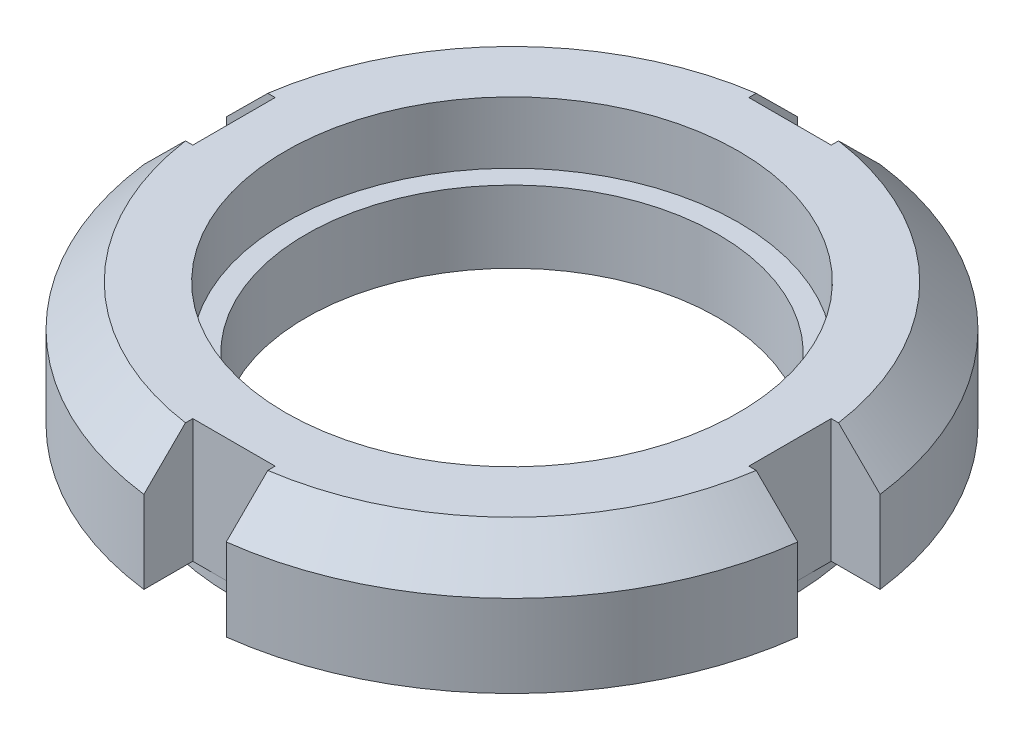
from build123d import *

# Parameters (mm, degrees)
ESQUISSE10_W                 = 2.5
ESQUISSE10_H                 = 4
ENL_V_MAT_EXTRU_1_DEPTH      = 24.542514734
R_P_TITION_CIRCULAIRE1_COUNT = 4


with BuildPart() as part:
    # Esquisse9 → R_volution1 (revolve)
    with BuildSketch(Plane.XY, mode=Mode.PRIVATE) as r_volution1_sk:
        Polygon((10, 0), (13.5, 0), (13.5, 0.5), (16, 0.5), (16, 4.5), (14, 6.5), (11, 6.5), (11, 3.5), (10, 3.5), align=None)
    revolve(r_volution1_sk.sketch.rotate(Axis((0, 0, 0), (0, 1, 0)), 90), axis=Axis((0, 0, 0), (0, 1, 0)))

    # Esquisse10 → Enl_v. mat.-Extru.1 (cut, through all)
    with BuildSketch(Plane(origin=(0, 6.5, 0), x_dir=(-1, 0, 0), z_dir=(0, 1, 0))):
        with Locations((-14.75, 0)):
            Rectangle(ESQUISSE10_W, ESQUISSE10_H)
    enl_v_mat_extru_1 = extrude(amount=-ENL_V_MAT_EXTRU_1_DEPTH, mode=Mode.SUBTRACT)

    # R_p_tition circulaire1: Enl_v. mat.-Extru.1 ×4 about axis
    r_p_tition_circulaire1_axis = Axis((0, 0, 0), (0, 1, 0))
    for i in range(1, R_P_TITION_CIRCULAIRE1_COUNT):
        add(enl_v_mat_extru_1.rotate(r_p_tition_circulaire1_axis, i * 360 / R_P_TITION_CIRCULAIRE1_COUNT), mode=Mode.SUBTRACT)


solid = part.part
